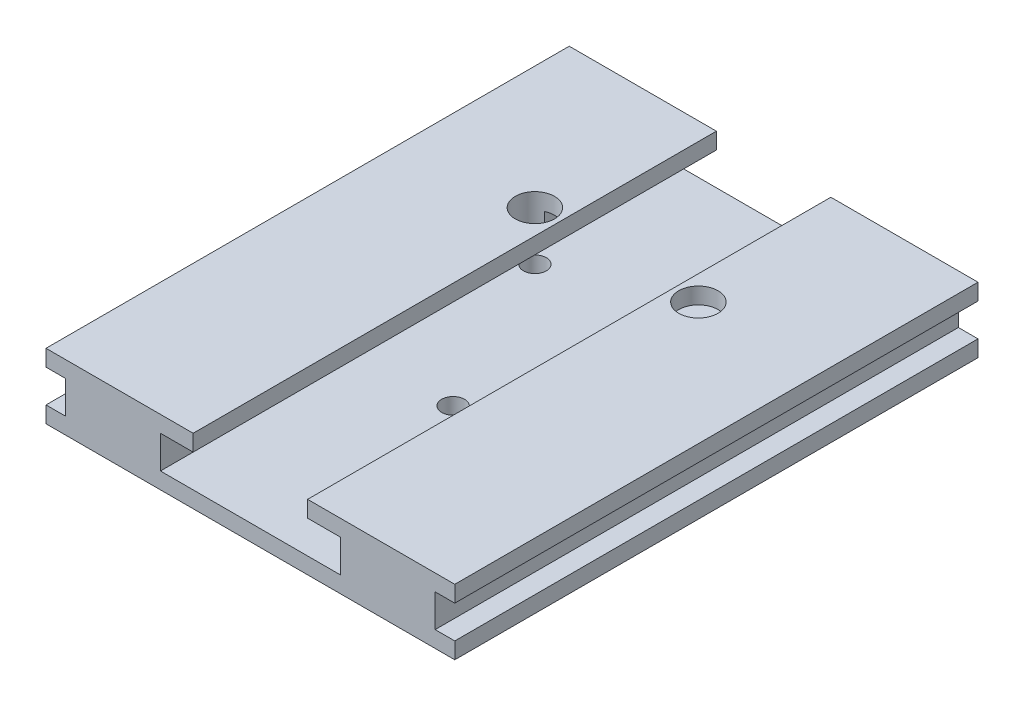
ISO-10303-21;
HEADER;
FILE_DESCRIPTION(('STEP AP214'),'2;1');
FILE_NAME('part.step','',(''),(''),'','','');
FILE_SCHEMA(('AUTOMOTIVE_DESIGN { 1 0 10303 214 1 1 1 1 }'));
ENDSEC;
DATA;
#1=APPLICATION_CONTEXT('core data for automotive mechanical design processes');
#2=APPLICATION_PROTOCOL_DEFINITION('international standard','automotive_design',2000,#1);
#3=PRODUCT_CONTEXT('',#1,'mechanical');
#4=PRODUCT('Part','Part','',(#3));
#5=PRODUCT_RELATED_PRODUCT_CATEGORY('part','',(#4));
#6=PRODUCT_DEFINITION_FORMATION('','',#4);
#7=PRODUCT_DEFINITION_CONTEXT('part definition',#1,'design');
#8=PRODUCT_DEFINITION('design','',#6,#7);
#9=PRODUCT_DEFINITION_SHAPE('','',#8);
#10=(LENGTH_UNIT() NAMED_UNIT(*) SI_UNIT(.MILLI.,.METRE.));
#11=(NAMED_UNIT(*) PLANE_ANGLE_UNIT() SI_UNIT($,.RADIAN.));
#12=(NAMED_UNIT(*) SI_UNIT($,.STERADIAN.) SOLID_ANGLE_UNIT());
#13=UNCERTAINTY_MEASURE_WITH_UNIT(LENGTH_MEASURE(1.E-05),#10,'distance_accuracy_value','');
#14=(GEOMETRIC_REPRESENTATION_CONTEXT(3) GLOBAL_UNCERTAINTY_ASSIGNED_CONTEXT((#13)) GLOBAL_UNIT_ASSIGNED_CONTEXT((#10,
#11,#12)) REPRESENTATION_CONTEXT('',''));
#15=CARTESIAN_POINT('',(0.,0.,0.));
#16=DIRECTION('',(0.,0.,1.));
#17=DIRECTION('',(1.,0.,0.));
#18=AXIS2_PLACEMENT_3D('',#15,#16,#17);
#19=CARTESIAN_POINT('',(41.2911870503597,-47.1775179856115,248.));
#20=DIRECTION('',(0.,-1.,0.));
#21=DIRECTION('',(0.,0.,-1.));
#22=AXIS2_PLACEMENT_3D('',#19,#20,#21);
#23=CYLINDRICAL_SURFACE('',#22,3.5);
#24=CARTESIAN_POINT('',(41.2911870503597,-67.1775179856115,248.));
#25=DIRECTION('',(0.,-1.,0.));
#26=DIRECTION('',(0.,0.,-1.));
#27=AXIS2_PLACEMENT_3D('',#24,#25,#26);
#28=CIRCLE('',#27,3.5);
#29=CARTESIAN_POINT('',(41.2911870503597,-67.1775179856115,244.5));
#30=VERTEX_POINT('',#29);
#31=EDGE_CURVE('E312',#30,#30,#28,.T.);
#32=ORIENTED_EDGE('',*,*,#31,.T.);
#33=EDGE_LOOP('',(#32));
#34=FACE_BOUND('',#33,.T.);
#35=CARTESIAN_POINT('',(41.2911870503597,-62.1775179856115,248.));
#36=DIRECTION('',(0.,-1.,0.));
#37=DIRECTION('',(1.,0.,0.));
#38=AXIS2_PLACEMENT_3D('',#35,#36,#37);
#39=CIRCLE('',#38,3.5);
#40=CARTESIAN_POINT('',(44.7911870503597,-62.1775179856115,248.));
#41=VERTEX_POINT('',#40);
#42=EDGE_CURVE('E293',#41,#41,#39,.T.);
#43=ORIENTED_EDGE('',*,*,#42,.F.);
#44=EDGE_LOOP('',(#43));
#45=FACE_BOUND('',#44,.T.);
#46=ADVANCED_FACE('F33',(#34,#45),#23,.F.);
#47=CARTESIAN_POINT('',(-8.70881294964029,-47.1775179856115,248.));
#48=DIRECTION('',(0.,-1.,0.));
#49=DIRECTION('',(0.,0.,-1.));
#50=AXIS2_PLACEMENT_3D('',#47,#48,#49);
#51=CYLINDRICAL_SURFACE('',#50,3.5);
#52=CARTESIAN_POINT('',(-8.70881294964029,-67.1775179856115,248.));
#53=DIRECTION('',(0.,-1.,0.));
#54=DIRECTION('',(0.,0.,-1.));
#55=AXIS2_PLACEMENT_3D('',#52,#53,#54);
#56=CIRCLE('',#55,3.5);
#57=CARTESIAN_POINT('',(-8.70881294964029,-67.1775179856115,244.5));
#58=VERTEX_POINT('',#57);
#59=EDGE_CURVE('E298',#58,#58,#56,.T.);
#60=ORIENTED_EDGE('',*,*,#59,.T.);
#61=EDGE_LOOP('',(#60));
#62=FACE_BOUND('',#61,.T.);
#63=CARTESIAN_POINT('',(-8.70881294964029,-62.1775179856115,248.));
#64=DIRECTION('',(0.,-1.,0.));
#65=DIRECTION('',(1.,0.,0.));
#66=AXIS2_PLACEMENT_3D('',#63,#64,#65);
#67=CIRCLE('',#66,3.5);
#68=CARTESIAN_POINT('',(-5.20881294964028,-62.1775179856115,248.));
#69=VERTEX_POINT('',#68);
#70=EDGE_CURVE('E416',#69,#69,#67,.T.);
#71=ORIENTED_EDGE('',*,*,#70,.F.);
#72=EDGE_LOOP('',(#71));
#73=FACE_BOUND('',#72,.T.);
#74=ADVANCED_FACE('F473',(#62,#73),#51,.F.);
#75=CARTESIAN_POINT('',(-11.2088129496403,-62.1775179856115,0.));
#76=DIRECTION('',(-1.,0.,0.));
#77=DIRECTION('',(0.,0.,1.));
#78=AXIS2_PLACEMENT_3D('',#75,#76,#77);
#79=PLANE('',#78);
#80=DIRECTION('',(0.,0.,1.));
#81=VECTOR('',#80,1.);
#82=CARTESIAN_POINT('',(-11.2088129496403,-52.1775179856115,0.));
#83=LINE('',#82,#81);
#84=CARTESIAN_POINT('',(-11.2088129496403,-52.1775179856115,200.));
#85=VERTEX_POINT('',#84);
#86=CARTESIAN_POINT('',(-11.2088129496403,-52.1775179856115,242.545643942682));
#87=VERTEX_POINT('',#86);
#88=EDGE_CURVE('E214',#85,#87,#83,.T.);
#89=ORIENTED_EDGE('',*,*,#88,.T.);
#90=DIRECTION('',(0.,1.,0.));
#91=VECTOR('',#90,1.);
#92=CARTESIAN_POINT('',(-11.2088129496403,-62.1775179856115,242.545643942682));
#93=LINE('',#92,#91);
#94=CARTESIAN_POINT('',(-11.2088129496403,-62.1775179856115,242.545643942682));
#95=VERTEX_POINT('',#94);
#96=EDGE_CURVE('E198',#87,#95,#93,.F.);
#97=ORIENTED_EDGE('',*,*,#96,.T.);
#98=DIRECTION('',(0.,0.,1.));
#99=VECTOR('',#98,1.);
#100=CARTESIAN_POINT('',(-11.2088129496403,-62.1775179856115,0.));
#101=LINE('',#100,#99);
#102=CARTESIAN_POINT('',(-11.2088129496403,-62.1775179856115,200.));
#103=VERTEX_POINT('',#102);
#104=EDGE_CURVE('E212',#103,#95,#101,.T.);
#105=ORIENTED_EDGE('',*,*,#104,.F.);
#106=DIRECTION('',(0.,1.,0.));
#107=VECTOR('',#106,1.);
#108=CARTESIAN_POINT('',(-11.2088129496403,-62.1775179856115,200.));
#109=LINE('',#108,#107);
#110=EDGE_CURVE('E379',#103,#85,#109,.T.);
#111=ORIENTED_EDGE('',*,*,#110,.T.);
#112=EDGE_LOOP('',(#89,#97,#105,#111));
#113=FACE_BOUND('',#112,.T.);
#114=ADVANCED_FACE('F210',(#113),#79,.F.);
#115=CARTESIAN_POINT('',(43.7911870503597,-52.1775179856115,0.));
#116=DIRECTION('',(1.,0.,0.));
#117=DIRECTION('',(0.,0.,-1.));
#118=AXIS2_PLACEMENT_3D('',#115,#116,#117);
#119=PLANE('',#118);
#120=DIRECTION('',(0.,0.,1.));
#121=VECTOR('',#120,1.);
#122=CARTESIAN_POINT('',(43.7911870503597,-52.1775179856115,0.));
#123=LINE('',#122,#121);
#124=CARTESIAN_POINT('',(43.7911870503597,-52.1775179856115,253.454356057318));
#125=VERTEX_POINT('',#124);
#126=CARTESIAN_POINT('',(43.7911870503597,-52.1775179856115,360.));
#127=VERTEX_POINT('',#126);
#128=EDGE_CURVE('E340',#125,#127,#123,.T.);
#129=ORIENTED_EDGE('',*,*,#128,.F.);
#130=DIRECTION('',(0.,1.,0.));
#131=VECTOR('',#130,1.);
#132=CARTESIAN_POINT('',(43.7911870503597,-62.1775179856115,253.454356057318));
#133=LINE('',#132,#131);
#134=CARTESIAN_POINT('',(43.7911870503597,-62.1775179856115,253.454356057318));
#135=VERTEX_POINT('',#134);
#136=EDGE_CURVE('E367',#125,#135,#133,.F.);
#137=ORIENTED_EDGE('',*,*,#136,.T.);
#138=DIRECTION('',(0.,0.,1.));
#139=VECTOR('',#138,1.);
#140=CARTESIAN_POINT('',(43.7911870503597,-62.1775179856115,0.));
#141=LINE('',#140,#139);
#142=CARTESIAN_POINT('',(43.7911870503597,-62.1775179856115,360.));
#143=VERTEX_POINT('',#142);
#144=EDGE_CURVE('E222',#135,#143,#141,.T.);
#145=ORIENTED_EDGE('',*,*,#144,.T.);
#146=DIRECTION('',(0.,1.,0.));
#147=VECTOR('',#146,1.);
#148=CARTESIAN_POINT('',(43.7911870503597,-52.1775179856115,360.));
#149=LINE('',#148,#147);
#150=EDGE_CURVE('E326',#143,#127,#149,.T.);
#151=ORIENTED_EDGE('',*,*,#150,.T.);
#152=EDGE_LOOP('',(#129,#137,#145,#151));
#153=FACE_BOUND('',#152,.T.);
#154=ADVANCED_FACE('F456',(#153),#119,.F.);
#155=CARTESIAN_POINT('',(-46.2088129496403,-47.1775179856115,360.));
#156=DIRECTION('',(0.,-1.,0.));
#157=DIRECTION('',(0.,0.,-1.));
#158=AXIS2_PLACEMENT_3D('',#155,#156,#157);
#159=PLANE('',#158);
#160=CARTESIAN_POINT('',(-8.70881294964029,-47.1775179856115,248.));
#161=DIRECTION('',(0.,1.,0.));
#162=DIRECTION('',(0.,0.,1.));
#163=AXIS2_PLACEMENT_3D('',#160,#161,#162);
#164=CIRCLE('',#163,6.);
#165=CARTESIAN_POINT('',(-8.70881294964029,-47.1775179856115,254.));
#166=VERTEX_POINT('',#165);
#167=EDGE_CURVE('E205',#166,#166,#164,.T.);
#168=ORIENTED_EDGE('',*,*,#167,.F.);
#169=EDGE_LOOP('',(#168));
#170=FACE_BOUND('',#169,.T.);
#171=DIRECTION('',(0.,0.,1.));
#172=VECTOR('',#171,1.);
#173=CARTESIAN_POINT('',(-1.20881294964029,-47.1775179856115,0.));
#174=LINE('',#173,#172);
#175=CARTESIAN_POINT('',(-1.20881294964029,-47.1775179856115,200.));
#176=VERTEX_POINT('',#175);
#177=CARTESIAN_POINT('',(-1.20881294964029,-47.1775179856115,360.));
#178=VERTEX_POINT('',#177);
#179=EDGE_CURVE('E238',#176,#178,#174,.T.);
#180=ORIENTED_EDGE('',*,*,#179,.F.);
#181=DIRECTION('',(1.,0.,0.));
#182=VECTOR('',#181,1.);
#183=CARTESIAN_POINT('',(-46.2088129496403,-47.1775179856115,200.));
#184=LINE('',#183,#182);
#185=CARTESIAN_POINT('',(-46.2088129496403,-47.1775179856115,200.));
#186=VERTEX_POINT('',#185);
#187=EDGE_CURVE('E374',#186,#176,#184,.T.);
#188=ORIENTED_EDGE('',*,*,#187,.F.);
#189=DIRECTION('',(0.,0.,-1.));
#190=VECTOR('',#189,1.);
#191=CARTESIAN_POINT('',(-46.2088129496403,-47.1775179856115,360.));
#192=LINE('',#191,#190);
#193=CARTESIAN_POINT('',(-46.2088129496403,-47.1775179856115,360.));
#194=VERTEX_POINT('',#193);
#195=EDGE_CURVE('E281',#194,#186,#192,.T.);
#196=ORIENTED_EDGE('',*,*,#195,.F.);
#197=DIRECTION('',(-1.,0.,0.));
#198=VECTOR('',#197,1.);
#199=CARTESIAN_POINT('',(-46.2088129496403,-47.1775179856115,360.));
#200=LINE('',#199,#198);
#201=EDGE_CURVE('E56',#178,#194,#200,.T.);
#202=ORIENTED_EDGE('',*,*,#201,.F.);
#203=EDGE_LOOP('',(#180,#188,#196,#202));
#204=FACE_BOUND('',#203,.T.);
#205=ADVANCED_FACE('F454',(#170,#204),#159,.F.);
#206=CARTESIAN_POINT('',(-46.2088129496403,-47.1775179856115,360.));
#207=DIRECTION('',(1.,0.,0.));
#208=DIRECTION('',(0.,0.,-1.));
#209=AXIS2_PLACEMENT_3D('',#206,#207,#208);
#210=PLANE('',#209);
#211=ORIENTED_EDGE('',*,*,#195,.T.);
#212=DIRECTION('',(0.,1.,0.));
#213=VECTOR('',#212,1.);
#214=CARTESIAN_POINT('',(-46.2088129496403,-67.1775179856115,200.));
#215=LINE('',#214,#213);
#216=CARTESIAN_POINT('',(-46.2088129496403,-52.1775179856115,200.));
#217=VERTEX_POINT('',#216);
#218=EDGE_CURVE('E373',#217,#186,#215,.T.);
#219=ORIENTED_EDGE('',*,*,#218,.F.);
#220=DIRECTION('',(0.,0.,1.));
#221=VECTOR('',#220,1.);
#222=CARTESIAN_POINT('',(-46.2088129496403,-52.1775179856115,0.));
#223=LINE('',#222,#221);
#224=CARTESIAN_POINT('',(-46.2088129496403,-52.1775179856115,360.));
#225=VERTEX_POINT('',#224);
#226=EDGE_CURVE('E245',#217,#225,#223,.T.);
#227=ORIENTED_EDGE('',*,*,#226,.T.);
#228=DIRECTION('',(0.,-1.,0.));
#229=VECTOR('',#228,1.);
#230=CARTESIAN_POINT('',(-46.2088129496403,-47.1775179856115,360.));
#231=LINE('',#230,#229);
#232=EDGE_CURVE('E270',#194,#225,#231,.T.);
#233=ORIENTED_EDGE('',*,*,#232,.F.);
#234=EDGE_LOOP('',(#211,#219,#227,#233));
#235=FACE_BOUND('',#234,.T.);
#236=ADVANCED_FACE('F451',(#235),#210,.F.);
#237=CARTESIAN_POINT('',(78.7911870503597,-47.1775179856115,360.));
#238=DIRECTION('',(-1.,0.,0.));
#239=DIRECTION('',(0.,-1.,0.));
#240=AXIS2_PLACEMENT_3D('',#237,#238,#239);
#241=PLANE('',#240);
#242=DIRECTION('',(0.,0.,-1.));
#243=VECTOR('',#242,1.);
#244=CARTESIAN_POINT('',(78.7911870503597,-67.1775179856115,360.));
#245=LINE('',#244,#243);
#246=CARTESIAN_POINT('',(78.7911870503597,-67.1775179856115,360.));
#247=VERTEX_POINT('',#246);
#248=CARTESIAN_POINT('',(78.7911870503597,-67.1775179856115,200.));
#249=VERTEX_POINT('',#248);
#250=EDGE_CURVE('E287',#247,#249,#245,.T.);
#251=ORIENTED_EDGE('',*,*,#250,.T.);
#252=DIRECTION('',(0.,1.,0.));
#253=VECTOR('',#252,1.);
#254=CARTESIAN_POINT('',(78.7911870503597,-47.1775179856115,200.));
#255=LINE('',#254,#253);
#256=CARTESIAN_POINT('',(78.7911870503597,-62.1775179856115,200.));
#257=VERTEX_POINT('',#256);
#258=EDGE_CURVE('E409',#249,#257,#255,.T.);
#259=ORIENTED_EDGE('',*,*,#258,.T.);
#260=DIRECTION('',(0.,0.,1.));
#261=VECTOR('',#260,1.);
#262=CARTESIAN_POINT('',(78.7911870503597,-62.1775179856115,0.));
#263=LINE('',#262,#261);
#264=CARTESIAN_POINT('',(78.7911870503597,-62.1775179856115,360.));
#265=VERTEX_POINT('',#264);
#266=EDGE_CURVE('E262',#257,#265,#263,.T.);
#267=ORIENTED_EDGE('',*,*,#266,.T.);
#268=DIRECTION('',(0.,1.,0.));
#269=VECTOR('',#268,1.);
#270=CARTESIAN_POINT('',(78.7911870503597,-47.1775179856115,360.));
#271=LINE('',#270,#269);
#272=EDGE_CURVE('E275',#247,#265,#271,.T.);
#273=ORIENTED_EDGE('',*,*,#272,.F.);
#274=EDGE_LOOP('',(#251,#259,#267,#273));
#275=FACE_BOUND('',#274,.T.);
#276=ADVANCED_FACE('F464',(#275),#241,.F.);
#277=DIRECTION('',(0.,0.,1.));
#278=VECTOR('',#277,1.);
#279=CARTESIAN_POINT('',(-46.2088129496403,-62.1775179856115,0.));
#280=LINE('',#279,#278);
#281=CARTESIAN_POINT('',(-46.2088129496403,-62.1775179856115,200.));
#282=VERTEX_POINT('',#281);
#283=CARTESIAN_POINT('',(-46.2088129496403,-62.1775179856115,360.));
#284=VERTEX_POINT('',#283);
#285=EDGE_CURVE('E244',#282,#284,#280,.T.);
#286=ORIENTED_EDGE('',*,*,#285,.F.);
#287=CARTESIAN_POINT('',(-46.2088129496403,-67.1775179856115,200.));
#288=VERTEX_POINT('',#287);
#289=EDGE_CURVE('E376',#288,#282,#215,.T.);
#290=ORIENTED_EDGE('',*,*,#289,.F.);
#291=DIRECTION('',(0.,0.,-1.));
#292=VECTOR('',#291,1.);
#293=CARTESIAN_POINT('',(-46.2088129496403,-67.1775179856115,360.));
#294=LINE('',#293,#292);
#295=CARTESIAN_POINT('',(-46.2088129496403,-67.1775179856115,360.));
#296=VERTEX_POINT('',#295);
#297=EDGE_CURVE('E290',#296,#288,#294,.T.);
#298=ORIENTED_EDGE('',*,*,#297,.F.);
#299=EDGE_CURVE('E264',#284,#296,#231,.T.);
#300=ORIENTED_EDGE('',*,*,#299,.F.);
#301=EDGE_LOOP('',(#286,#290,#298,#300));
#302=FACE_BOUND('',#301,.T.);
#303=ADVANCED_FACE('F35',(#302),#210,.F.);
#304=CARTESIAN_POINT('',(-46.2088129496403,-67.1775179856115,360.));
#305=DIRECTION('',(0.,1.,0.));
#306=DIRECTION('',(0.,0.,1.));
#307=AXIS2_PLACEMENT_3D('',#304,#305,#306);
#308=PLANE('',#307);
#309=CARTESIAN_POINT('',(16.2911870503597,-67.1775179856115,298.));
#310=DIRECTION('',(0.,-1.,0.));
#311=DIRECTION('',(0.,0.,-1.));
#312=AXIS2_PLACEMENT_3D('',#309,#310,#311);
#313=CIRCLE('',#312,3.5);
#314=CARTESIAN_POINT('',(16.2911870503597,-67.1775179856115,294.5));
#315=VERTEX_POINT('',#314);
#316=EDGE_CURVE('E299',#315,#315,#313,.T.);
#317=ORIENTED_EDGE('',*,*,#316,.F.);
#318=EDGE_LOOP('',(#317));
#319=FACE_BOUND('',#318,.T.);
#320=ORIENTED_EDGE('',*,*,#59,.F.);
#321=EDGE_LOOP('',(#320));
#322=FACE_BOUND('',#321,.T.);
#323=ORIENTED_EDGE('',*,*,#31,.F.);
#324=EDGE_LOOP('',(#323));
#325=FACE_BOUND('',#324,.T.);
#326=ORIENTED_EDGE('',*,*,#297,.T.);
#327=DIRECTION('',(1.,0.,0.));
#328=VECTOR('',#327,1.);
#329=CARTESIAN_POINT('',(-46.2088129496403,-67.1775179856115,200.));
#330=LINE('',#329,#328);
#331=EDGE_CURVE('E370',#288,#249,#330,.T.);
#332=ORIENTED_EDGE('',*,*,#331,.T.);
#333=ORIENTED_EDGE('',*,*,#250,.F.);
#334=DIRECTION('',(1.,0.,0.));
#335=VECTOR('',#334,1.);
#336=CARTESIAN_POINT('',(-46.2088129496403,-67.1775179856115,360.));
#337=LINE('',#336,#335);
#338=EDGE_CURVE('E272',#296,#247,#337,.T.);
#339=ORIENTED_EDGE('',*,*,#338,.F.);
#340=EDGE_LOOP('',(#326,#332,#333,#339));
#341=FACE_BOUND('',#340,.T.);
#342=ADVANCED_FACE('F423',(#319,#322,#325,#341),#308,.F.);
#343=DIRECTION('',(0.,0.,1.));
#344=VECTOR('',#343,1.);
#345=CARTESIAN_POINT('',(78.7911870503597,-52.1775179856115,0.));
#346=LINE('',#345,#344);
#347=CARTESIAN_POINT('',(78.7911870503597,-52.1775179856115,200.));
#348=VERTEX_POINT('',#347);
#349=CARTESIAN_POINT('',(78.7911870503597,-52.1775179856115,360.));
#350=VERTEX_POINT('',#349);
#351=EDGE_CURVE('E261',#348,#350,#346,.T.);
#352=ORIENTED_EDGE('',*,*,#351,.F.);
#353=DIRECTION('',(0.,1.,0.));
#354=VECTOR('',#353,1.);
#355=CARTESIAN_POINT('',(78.7911870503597,-47.1775179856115,200.));
#356=LINE('',#355,#354);
#357=CARTESIAN_POINT('',(78.7911870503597,-47.1775179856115,200.));
#358=VERTEX_POINT('',#357);
#359=EDGE_CURVE('E406',#348,#358,#356,.T.);
#360=ORIENTED_EDGE('',*,*,#359,.T.);
#361=DIRECTION('',(0.,0.,-1.));
#362=VECTOR('',#361,1.);
#363=CARTESIAN_POINT('',(78.7911870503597,-47.1775179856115,360.));
#364=LINE('',#363,#362);
#365=CARTESIAN_POINT('',(78.7911870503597,-47.1775179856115,360.));
#366=VERTEX_POINT('',#365);
#367=EDGE_CURVE('E284',#366,#358,#364,.T.);
#368=ORIENTED_EDGE('',*,*,#367,.F.);
#369=EDGE_CURVE('E274',#350,#366,#271,.T.);
#370=ORIENTED_EDGE('',*,*,#369,.F.);
#371=EDGE_LOOP('',(#352,#360,#368,#370));
#372=FACE_BOUND('',#371,.T.);
#373=ADVANCED_FACE('F426',(#372),#241,.F.);
#374=CARTESIAN_POINT('',(41.2911870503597,-47.1775179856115,248.));
#375=DIRECTION('',(0.,1.,0.));
#376=DIRECTION('',(0.,0.,1.));
#377=AXIS2_PLACEMENT_3D('',#374,#375,#376);
#378=CIRCLE('',#377,6.);
#379=CARTESIAN_POINT('',(41.2911870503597,-47.1775179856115,254.));
#380=VERTEX_POINT('',#379);
#381=EDGE_CURVE('E204',#380,#380,#378,.T.);
#382=ORIENTED_EDGE('',*,*,#381,.F.);
#383=EDGE_LOOP('',(#382));
#384=FACE_BOUND('',#383,.T.);
#385=ORIENTED_EDGE('',*,*,#367,.T.);
#386=CARTESIAN_POINT('',(33.7911870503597,-47.1775179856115,200.));
#387=VERTEX_POINT('',#386);
#388=EDGE_CURVE('E369',#387,#358,#184,.T.);
#389=ORIENTED_EDGE('',*,*,#388,.F.);
#390=DIRECTION('',(0.,0.,1.));
#391=VECTOR('',#390,1.);
#392=CARTESIAN_POINT('',(33.7911870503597,-47.1775179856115,0.));
#393=LINE('',#392,#391);
#394=CARTESIAN_POINT('',(33.7911870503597,-47.1775179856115,360.));
#395=VERTEX_POINT('',#394);
#396=EDGE_CURVE('E335',#387,#395,#393,.T.);
#397=ORIENTED_EDGE('',*,*,#396,.T.);
#398=EDGE_CURVE('E278',#366,#395,#200,.T.);
#399=ORIENTED_EDGE('',*,*,#398,.F.);
#400=EDGE_LOOP('',(#385,#389,#397,#399));
#401=FACE_BOUND('',#400,.T.);
#402=ADVANCED_FACE('F459',(#384,#401),#159,.F.);
#403=CARTESIAN_POINT('',(-46.2088129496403,-67.1775179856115,360.));
#404=DIRECTION('',(0.,0.,1.));
#405=DIRECTION('',(1.,0.,0.));
#406=AXIS2_PLACEMENT_3D('',#403,#404,#405);
#407=PLANE('',#406);
#408=DIRECTION('',(0.,-1.,0.));
#409=VECTOR('',#408,1.);
#410=CARTESIAN_POINT('',(-1.20881294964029,-47.1775179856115,360.));
#411=LINE('',#410,#409);
#412=CARTESIAN_POINT('',(-1.20881294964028,-52.1775179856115,360.));
#413=VERTEX_POINT('',#412);
#414=EDGE_CURVE('E309',#178,#413,#411,.T.);
#415=ORIENTED_EDGE('',*,*,#414,.F.);
#416=ORIENTED_EDGE('',*,*,#201,.T.);
#417=ORIENTED_EDGE('',*,*,#232,.T.);
#418=DIRECTION('',(-1.,0.,0.));
#419=VECTOR('',#418,1.);
#420=CARTESIAN_POINT('',(-46.2088129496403,-52.1775179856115,360.));
#421=LINE('',#420,#419);
#422=CARTESIAN_POINT('',(-40.2088129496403,-52.1775179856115,360.));
#423=VERTEX_POINT('',#422);
#424=EDGE_CURVE('E241',#423,#225,#421,.T.);
#425=ORIENTED_EDGE('',*,*,#424,.F.);
#426=DIRECTION('',(0.,1.,0.));
#427=VECTOR('',#426,1.);
#428=CARTESIAN_POINT('',(-40.2088129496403,-52.1775179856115,360.));
#429=LINE('',#428,#427);
#430=CARTESIAN_POINT('',(-40.2088129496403,-62.1775179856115,360.));
#431=VERTEX_POINT('',#430);
#432=EDGE_CURVE('E237',#431,#423,#429,.T.);
#433=ORIENTED_EDGE('',*,*,#432,.F.);
#434=DIRECTION('',(1.,0.,0.));
#435=VECTOR('',#434,1.);
#436=CARTESIAN_POINT('',(-46.2088129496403,-62.1775179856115,360.));
#437=LINE('',#436,#435);
#438=EDGE_CURVE('E234',#284,#431,#437,.T.);
#439=ORIENTED_EDGE('',*,*,#438,.F.);
#440=ORIENTED_EDGE('',*,*,#299,.T.);
#441=ORIENTED_EDGE('',*,*,#338,.T.);
#442=ORIENTED_EDGE('',*,*,#272,.T.);
#443=DIRECTION('',(1.,0.,0.));
#444=VECTOR('',#443,1.);
#445=CARTESIAN_POINT('',(78.7911870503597,-62.1775179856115,360.));
#446=LINE('',#445,#444);
#447=CARTESIAN_POINT('',(72.7911870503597,-62.1775179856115,360.));
#448=VERTEX_POINT('',#447);
#449=EDGE_CURVE('E258',#448,#265,#446,.T.);
#450=ORIENTED_EDGE('',*,*,#449,.F.);
#451=DIRECTION('',(0.,-1.,0.));
#452=VECTOR('',#451,1.);
#453=CARTESIAN_POINT('',(72.7911870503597,-52.1775179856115,360.));
#454=LINE('',#453,#452);
#455=CARTESIAN_POINT('',(72.7911870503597,-52.1775179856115,360.));
#456=VERTEX_POINT('',#455);
#457=EDGE_CURVE('E255',#456,#448,#454,.T.);
#458=ORIENTED_EDGE('',*,*,#457,.F.);
#459=DIRECTION('',(-1.,0.,0.));
#460=VECTOR('',#459,1.);
#461=CARTESIAN_POINT('',(78.7911870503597,-52.1775179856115,360.));
#462=LINE('',#461,#460);
#463=EDGE_CURVE('E247',#350,#456,#462,.T.);
#464=ORIENTED_EDGE('',*,*,#463,.F.);
#465=ORIENTED_EDGE('',*,*,#369,.T.);
#466=ORIENTED_EDGE('',*,*,#398,.T.);
#467=DIRECTION('',(0.,1.,0.));
#468=VECTOR('',#467,1.);
#469=CARTESIAN_POINT('',(33.7911870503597,-47.1775179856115,360.));
#470=LINE('',#469,#468);
#471=CARTESIAN_POINT('',(33.7911870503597,-52.1775179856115,360.));
#472=VERTEX_POINT('',#471);
#473=EDGE_CURVE('E233',#472,#395,#470,.T.);
#474=ORIENTED_EDGE('',*,*,#473,.F.);
#475=DIRECTION('',(-1.,0.,0.));
#476=VECTOR('',#475,1.);
#477=CARTESIAN_POINT('',(33.7911870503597,-52.1775179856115,360.));
#478=LINE('',#477,#476);
#479=EDGE_CURVE('E329',#127,#472,#478,.T.);
#480=ORIENTED_EDGE('',*,*,#479,.F.);
#481=ORIENTED_EDGE('',*,*,#150,.F.);
#482=DIRECTION('',(1.,0.,0.));
#483=VECTOR('',#482,1.);
#484=CARTESIAN_POINT('',(43.7911870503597,-62.1775179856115,360.));
#485=LINE('',#484,#483);
#486=CARTESIAN_POINT('',(-11.2088129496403,-62.1775179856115,360.));
#487=VERTEX_POINT('',#486);
#488=EDGE_CURVE('E320',#487,#143,#485,.T.);
#489=ORIENTED_EDGE('',*,*,#488,.F.);
#490=DIRECTION('',(0.,-1.,0.));
#491=VECTOR('',#490,1.);
#492=CARTESIAN_POINT('',(-11.2088129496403,-62.1775179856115,360.));
#493=LINE('',#492,#491);
#494=CARTESIAN_POINT('',(-11.2088129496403,-52.1775179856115,360.));
#495=VERTEX_POINT('',#494);
#496=EDGE_CURVE('E318',#495,#487,#493,.T.);
#497=ORIENTED_EDGE('',*,*,#496,.F.);
#498=DIRECTION('',(-1.,0.,0.));
#499=VECTOR('',#498,1.);
#500=CARTESIAN_POINT('',(-11.2088129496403,-52.1775179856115,360.));
#501=LINE('',#500,#499);
#502=EDGE_CURVE('E311',#413,#495,#501,.T.);
#503=ORIENTED_EDGE('',*,*,#502,.F.);
#504=EDGE_LOOP('',(#415,#416,#417,#425,#433,#439,#440,#441,#442,#450,#458,#464,#465,#466,#474,
#480,#481,#489,#497,#503));
#505=FACE_BOUND('',#504,.T.);
#506=ADVANCED_FACE('F315',(#505),#407,.T.);
#507=CARTESIAN_POINT('',(78.7911870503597,-62.1775179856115,0.));
#508=DIRECTION('',(0.,-1.,0.));
#509=DIRECTION('',(0.,0.,-1.));
#510=AXIS2_PLACEMENT_3D('',#507,#508,#509);
#511=PLANE('',#510);
#512=ORIENTED_EDGE('',*,*,#266,.F.);
#513=DIRECTION('',(-1.,0.,0.));
#514=VECTOR('',#513,1.);
#515=CARTESIAN_POINT('',(78.7911870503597,-62.1775179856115,200.));
#516=LINE('',#515,#514);
#517=CARTESIAN_POINT('',(72.7911870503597,-62.1775179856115,200.));
#518=VERTEX_POINT('',#517);
#519=EDGE_CURVE('E403',#257,#518,#516,.T.);
#520=ORIENTED_EDGE('',*,*,#519,.T.);
#521=DIRECTION('',(0.,0.,1.));
#522=VECTOR('',#521,1.);
#523=CARTESIAN_POINT('',(72.7911870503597,-62.1775179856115,0.));
#524=LINE('',#523,#522);
#525=EDGE_CURVE('E265',#518,#448,#524,.T.);
#526=ORIENTED_EDGE('',*,*,#525,.T.);
#527=ORIENTED_EDGE('',*,*,#449,.T.);
#528=EDGE_LOOP('',(#512,#520,#526,#527));
#529=FACE_BOUND('',#528,.T.);
#530=ADVANCED_FACE('F508',(#529),#511,.F.);
#531=CARTESIAN_POINT('',(72.7911870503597,-52.1775179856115,0.));
#532=DIRECTION('',(-1.,0.,0.));
#533=DIRECTION('',(0.,-1.,0.));
#534=AXIS2_PLACEMENT_3D('',#531,#532,#533);
#535=PLANE('',#534);
#536=ORIENTED_EDGE('',*,*,#525,.F.);
#537=DIRECTION('',(0.,1.,0.));
#538=VECTOR('',#537,1.);
#539=CARTESIAN_POINT('',(72.7911870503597,-52.1775179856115,200.));
#540=LINE('',#539,#538);
#541=CARTESIAN_POINT('',(72.7911870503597,-52.1775179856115,200.));
#542=VERTEX_POINT('',#541);
#543=EDGE_CURVE('E400',#518,#542,#540,.T.);
#544=ORIENTED_EDGE('',*,*,#543,.T.);
#545=DIRECTION('',(0.,0.,1.));
#546=VECTOR('',#545,1.);
#547=CARTESIAN_POINT('',(72.7911870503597,-52.1775179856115,0.));
#548=LINE('',#547,#546);
#549=EDGE_CURVE('E267',#542,#456,#548,.T.);
#550=ORIENTED_EDGE('',*,*,#549,.T.);
#551=ORIENTED_EDGE('',*,*,#457,.T.);
#552=EDGE_LOOP('',(#536,#544,#550,#551));
#553=FACE_BOUND('',#552,.T.);
#554=ADVANCED_FACE('F511',(#553),#535,.F.);
#555=CARTESIAN_POINT('',(78.7911870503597,-52.1775179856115,0.));
#556=DIRECTION('',(0.,1.,0.));
#557=DIRECTION('',(0.,0.,1.));
#558=AXIS2_PLACEMENT_3D('',#555,#556,#557);
#559=PLANE('',#558);
#560=ORIENTED_EDGE('',*,*,#549,.F.);
#561=DIRECTION('',(1.,0.,0.));
#562=VECTOR('',#561,1.);
#563=CARTESIAN_POINT('',(78.7911870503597,-52.1775179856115,200.));
#564=LINE('',#563,#562);
#565=EDGE_CURVE('E397',#542,#348,#564,.T.);
#566=ORIENTED_EDGE('',*,*,#565,.T.);
#567=ORIENTED_EDGE('',*,*,#351,.T.);
#568=ORIENTED_EDGE('',*,*,#463,.T.);
#569=EDGE_LOOP('',(#560,#566,#567,#568));
#570=FACE_BOUND('',#569,.T.);
#571=ADVANCED_FACE('F503',(#570),#559,.F.);
#572=CARTESIAN_POINT('',(-46.2088129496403,-52.1775179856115,0.));
#573=DIRECTION('',(0.,1.,0.));
#574=DIRECTION('',(0.,0.,1.));
#575=AXIS2_PLACEMENT_3D('',#572,#573,#574);
#576=PLANE('',#575);
#577=ORIENTED_EDGE('',*,*,#226,.F.);
#578=DIRECTION('',(1.,0.,0.));
#579=VECTOR('',#578,1.);
#580=CARTESIAN_POINT('',(-46.2088129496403,-52.1775179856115,200.));
#581=LINE('',#580,#579);
#582=CARTESIAN_POINT('',(-40.2088129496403,-52.1775179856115,200.));
#583=VERTEX_POINT('',#582);
#584=EDGE_CURVE('E394',#217,#583,#581,.T.);
#585=ORIENTED_EDGE('',*,*,#584,.T.);
#586=DIRECTION('',(0.,0.,1.));
#587=VECTOR('',#586,1.);
#588=CARTESIAN_POINT('',(-40.2088129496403,-52.1775179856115,0.));
#589=LINE('',#588,#587);
#590=EDGE_CURVE('E248',#583,#423,#589,.T.);
#591=ORIENTED_EDGE('',*,*,#590,.T.);
#592=ORIENTED_EDGE('',*,*,#424,.T.);
#593=EDGE_LOOP('',(#577,#585,#591,#592));
#594=FACE_BOUND('',#593,.T.);
#595=ADVANCED_FACE('F448',(#594),#576,.F.);
#596=CARTESIAN_POINT('',(-40.2088129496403,-52.1775179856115,0.));
#597=DIRECTION('',(1.,0.,0.));
#598=DIRECTION('',(0.,1.,0.));
#599=AXIS2_PLACEMENT_3D('',#596,#597,#598);
#600=PLANE('',#599);
#601=ORIENTED_EDGE('',*,*,#590,.F.);
#602=DIRECTION('',(0.,-1.,0.));
#603=VECTOR('',#602,1.);
#604=CARTESIAN_POINT('',(-40.2088129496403,-52.1775179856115,200.));
#605=LINE('',#604,#603);
#606=CARTESIAN_POINT('',(-40.2088129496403,-62.1775179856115,200.));
#607=VERTEX_POINT('',#606);
#608=EDGE_CURVE('E391',#583,#607,#605,.T.);
#609=ORIENTED_EDGE('',*,*,#608,.T.);
#610=DIRECTION('',(0.,0.,1.));
#611=VECTOR('',#610,1.);
#612=CARTESIAN_POINT('',(-40.2088129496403,-62.1775179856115,0.));
#613=LINE('',#612,#611);
#614=EDGE_CURVE('E250',#607,#431,#613,.T.);
#615=ORIENTED_EDGE('',*,*,#614,.T.);
#616=ORIENTED_EDGE('',*,*,#432,.T.);
#617=EDGE_LOOP('',(#601,#609,#615,#616));
#618=FACE_BOUND('',#617,.T.);
#619=ADVANCED_FACE('F443',(#618),#600,.F.);
#620=CARTESIAN_POINT('',(-46.2088129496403,-62.1775179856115,0.));
#621=DIRECTION('',(0.,-1.,0.));
#622=DIRECTION('',(0.,0.,-1.));
#623=AXIS2_PLACEMENT_3D('',#620,#621,#622);
#624=PLANE('',#623);
#625=ORIENTED_EDGE('',*,*,#614,.F.);
#626=DIRECTION('',(-1.,0.,0.));
#627=VECTOR('',#626,1.);
#628=CARTESIAN_POINT('',(-46.2088129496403,-62.1775179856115,200.));
#629=LINE('',#628,#627);
#630=EDGE_CURVE('E388',#607,#282,#629,.T.);
#631=ORIENTED_EDGE('',*,*,#630,.T.);
#632=ORIENTED_EDGE('',*,*,#285,.T.);
#633=ORIENTED_EDGE('',*,*,#438,.T.);
#634=EDGE_LOOP('',(#625,#631,#632,#633));
#635=FACE_BOUND('',#634,.T.);
#636=ADVANCED_FACE('F438',(#635),#624,.F.);
#637=CARTESIAN_POINT('',(-1.20881294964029,-47.1775179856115,0.));
#638=DIRECTION('',(-1.,0.,0.));
#639=DIRECTION('',(0.,-1.,0.));
#640=AXIS2_PLACEMENT_3D('',#637,#638,#639);
#641=PLANE('',#640);
#642=DIRECTION('',(0.,0.,1.));
#643=VECTOR('',#642,1.);
#644=CARTESIAN_POINT('',(-1.20881294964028,-52.1775179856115,0.));
#645=LINE('',#644,#643);
#646=CARTESIAN_POINT('',(-1.20881294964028,-52.1775179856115,200.));
#647=VERTEX_POINT('',#646);
#648=EDGE_CURVE('E231',#647,#413,#645,.T.);
#649=ORIENTED_EDGE('',*,*,#648,.F.);
#650=DIRECTION('',(0.,1.,0.));
#651=VECTOR('',#650,1.);
#652=CARTESIAN_POINT('',(-1.20881294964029,-47.1775179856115,200.));
#653=LINE('',#652,#651);
#654=EDGE_CURVE('E48',#647,#176,#653,.T.);
#655=ORIENTED_EDGE('',*,*,#654,.T.);
#656=ORIENTED_EDGE('',*,*,#179,.T.);
#657=ORIENTED_EDGE('',*,*,#414,.T.);
#658=EDGE_LOOP('',(#649,#655,#656,#657));
#659=FACE_BOUND('',#658,.T.);
#660=ADVANCED_FACE('F307',(#659),#641,.F.);
#661=CARTESIAN_POINT('',(33.7911870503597,-47.1775179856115,0.));
#662=DIRECTION('',(1.,0.,0.));
#663=DIRECTION('',(0.,0.,-1.));
#664=AXIS2_PLACEMENT_3D('',#661,#662,#663);
#665=PLANE('',#664);
#666=ORIENTED_EDGE('',*,*,#396,.F.);
#667=DIRECTION('',(0.,-1.,0.));
#668=VECTOR('',#667,1.);
#669=CARTESIAN_POINT('',(33.7911870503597,-47.1775179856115,200.));
#670=LINE('',#669,#668);
#671=CARTESIAN_POINT('',(33.7911870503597,-52.1775179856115,200.));
#672=VERTEX_POINT('',#671);
#673=EDGE_CURVE('E385',#387,#672,#670,.T.);
#674=ORIENTED_EDGE('',*,*,#673,.T.);
#675=DIRECTION('',(0.,0.,1.));
#676=VECTOR('',#675,1.);
#677=CARTESIAN_POINT('',(33.7911870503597,-52.1775179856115,0.));
#678=LINE('',#677,#676);
#679=EDGE_CURVE('E337',#672,#472,#678,.T.);
#680=ORIENTED_EDGE('',*,*,#679,.T.);
#681=ORIENTED_EDGE('',*,*,#473,.T.);
#682=EDGE_LOOP('',(#666,#674,#680,#681));
#683=FACE_BOUND('',#682,.T.);
#684=ADVANCED_FACE('F482',(#683),#665,.F.);
#685=CARTESIAN_POINT('',(33.7911870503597,-52.1775179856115,0.));
#686=DIRECTION('',(0.,1.,0.));
#687=DIRECTION('',(0.,0.,1.));
#688=AXIS2_PLACEMENT_3D('',#685,#686,#687);
#689=PLANE('',#688);
#690=CARTESIAN_POINT('',(43.7911870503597,-52.1775179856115,200.));
#691=VERTEX_POINT('',#690);
#692=CARTESIAN_POINT('',(43.7911870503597,-52.1775179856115,242.545643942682));
#693=VERTEX_POINT('',#692);
#694=EDGE_CURVE('E338',#691,#693,#123,.T.);
#695=ORIENTED_EDGE('',*,*,#694,.T.);
#696=CARTESIAN_POINT('',(41.2911870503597,-52.1775179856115,248.));
#697=DIRECTION('',(0.,1.,0.));
#698=DIRECTION('',(0.,0.,1.));
#699=AXIS2_PLACEMENT_3D('',#696,#697,#698);
#700=CIRCLE('',#699,6.);
#701=EDGE_CURVE('E365',#693,#125,#700,.T.);
#702=ORIENTED_EDGE('',*,*,#701,.T.);
#703=ORIENTED_EDGE('',*,*,#128,.T.);
#704=ORIENTED_EDGE('',*,*,#479,.T.);
#705=ORIENTED_EDGE('',*,*,#679,.F.);
#706=DIRECTION('',(1.,0.,0.));
#707=VECTOR('',#706,1.);
#708=CARTESIAN_POINT('',(33.7911870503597,-52.1775179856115,200.));
#709=LINE('',#708,#707);
#710=EDGE_CURVE('E383',#672,#691,#709,.T.);
#711=ORIENTED_EDGE('',*,*,#710,.T.);
#712=EDGE_LOOP('',(#695,#702,#703,#704,#705,#711));
#713=FACE_BOUND('',#712,.T.);
#714=ADVANCED_FACE('F485',(#713),#689,.F.);
#715=CARTESIAN_POINT('',(43.7911870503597,-62.1775179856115,200.));
#716=VERTEX_POINT('',#715);
#717=CARTESIAN_POINT('',(43.7911870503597,-62.1775179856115,242.545643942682));
#718=VERTEX_POINT('',#717);
#719=EDGE_CURVE('E225',#716,#718,#141,.T.);
#720=ORIENTED_EDGE('',*,*,#719,.T.);
#721=DIRECTION('',(0.,1.,0.));
#722=VECTOR('',#721,1.);
#723=CARTESIAN_POINT('',(43.7911870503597,-62.1775179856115,242.545643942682));
#724=LINE('',#723,#722);
#725=EDGE_CURVE('E215',#718,#693,#724,.T.);
#726=ORIENTED_EDGE('',*,*,#725,.T.);
#727=ORIENTED_EDGE('',*,*,#694,.F.);
#728=DIRECTION('',(0.,-1.,0.));
#729=VECTOR('',#728,1.);
#730=CARTESIAN_POINT('',(43.7911870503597,-52.1775179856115,200.));
#731=LINE('',#730,#729);
#732=EDGE_CURVE('E351',#691,#716,#731,.T.);
#733=ORIENTED_EDGE('',*,*,#732,.T.);
#734=EDGE_LOOP('',(#720,#726,#727,#733));
#735=FACE_BOUND('',#734,.T.);
#736=ADVANCED_FACE('F350',(#735),#119,.F.);
#737=CARTESIAN_POINT('',(43.7911870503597,-62.1775179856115,0.));
#738=DIRECTION('',(0.,-1.,0.));
#739=DIRECTION('',(1.,0.,0.));
#740=AXIS2_PLACEMENT_3D('',#737,#738,#739);
#741=PLANE('',#740);
#742=ORIENTED_EDGE('',*,*,#104,.T.);
#743=CARTESIAN_POINT('',(-8.70881294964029,-62.1775179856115,248.));
#744=DIRECTION('',(0.,1.,0.));
#745=DIRECTION('',(0.,0.,1.));
#746=AXIS2_PLACEMENT_3D('',#743,#744,#745);
#747=CIRCLE('',#746,6.);
#748=CARTESIAN_POINT('',(-11.2088129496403,-62.1775179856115,253.454356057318));
#749=VERTEX_POINT('',#748);
#750=EDGE_CURVE('E195',#95,#749,#747,.T.);
#751=ORIENTED_EDGE('',*,*,#750,.T.);
#752=EDGE_CURVE('E223',#749,#487,#101,.T.);
#753=ORIENTED_EDGE('',*,*,#752,.T.);
#754=ORIENTED_EDGE('',*,*,#488,.T.);
#755=ORIENTED_EDGE('',*,*,#144,.F.);
#756=CARTESIAN_POINT('',(41.2911870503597,-62.1775179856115,248.));
#757=DIRECTION('',(0.,1.,0.));
#758=DIRECTION('',(0.,0.,1.));
#759=AXIS2_PLACEMENT_3D('',#756,#757,#758);
#760=CIRCLE('',#759,6.);
#761=EDGE_CURVE('E354',#135,#718,#760,.T.);
#762=ORIENTED_EDGE('',*,*,#761,.T.);
#763=ORIENTED_EDGE('',*,*,#719,.F.);
#764=DIRECTION('',(-1.,0.,0.));
#765=VECTOR('',#764,1.);
#766=CARTESIAN_POINT('',(43.7911870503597,-62.1775179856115,200.));
#767=LINE('',#766,#765);
#768=EDGE_CURVE('E221',#716,#103,#767,.T.);
#769=ORIENTED_EDGE('',*,*,#768,.T.);
#770=EDGE_LOOP('',(#742,#751,#753,#754,#755,#762,#763,#769));
#771=FACE_BOUND('',#770,.T.);
#772=ORIENTED_EDGE('',*,*,#70,.T.);
#773=EDGE_LOOP('',(#772));
#774=FACE_BOUND('',#773,.T.);
#775=CARTESIAN_POINT('',(16.2911870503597,-62.1775179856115,298.));
#776=DIRECTION('',(0.,-1.,0.));
#777=DIRECTION('',(1.,0.,0.));
#778=AXIS2_PLACEMENT_3D('',#775,#776,#777);
#779=CIRCLE('',#778,3.5);
#780=CARTESIAN_POINT('',(19.7911870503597,-62.1775179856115,298.));
#781=VERTEX_POINT('',#780);
#782=EDGE_CURVE('E296',#781,#781,#779,.T.);
#783=ORIENTED_EDGE('',*,*,#782,.T.);
#784=EDGE_LOOP('',(#783));
#785=FACE_BOUND('',#784,.T.);
#786=ORIENTED_EDGE('',*,*,#42,.T.);
#787=EDGE_LOOP('',(#786));
#788=FACE_BOUND('',#787,.T.);
#789=ADVANCED_FACE('F218',(#771,#774,#785,#788),#741,.F.);
#790=ORIENTED_EDGE('',*,*,#752,.F.);
#791=DIRECTION('',(0.,1.,0.));
#792=VECTOR('',#791,1.);
#793=CARTESIAN_POINT('',(-11.2088129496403,-62.1775179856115,253.454356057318));
#794=LINE('',#793,#792);
#795=CARTESIAN_POINT('',(-11.2088129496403,-52.1775179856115,253.454356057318));
#796=VERTEX_POINT('',#795);
#797=EDGE_CURVE('E200',#749,#796,#794,.T.);
#798=ORIENTED_EDGE('',*,*,#797,.T.);
#799=EDGE_CURVE('E230',#796,#495,#83,.T.);
#800=ORIENTED_EDGE('',*,*,#799,.T.);
#801=ORIENTED_EDGE('',*,*,#496,.T.);
#802=EDGE_LOOP('',(#790,#798,#800,#801));
#803=FACE_BOUND('',#802,.T.);
#804=ADVANCED_FACE('F492',(#803),#79,.F.);
#805=CARTESIAN_POINT('',(-11.2088129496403,-52.1775179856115,0.));
#806=DIRECTION('',(0.,1.,0.));
#807=DIRECTION('',(0.,0.,1.));
#808=AXIS2_PLACEMENT_3D('',#805,#806,#807);
#809=PLANE('',#808);
#810=ORIENTED_EDGE('',*,*,#799,.F.);
#811=CARTESIAN_POINT('',(-8.70881294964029,-52.1775179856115,248.));
#812=DIRECTION('',(0.,1.,0.));
#813=DIRECTION('',(0.,0.,1.));
#814=AXIS2_PLACEMENT_3D('',#811,#812,#813);
#815=CIRCLE('',#814,6.);
#816=EDGE_CURVE('E11',#796,#87,#815,.T.);
#817=ORIENTED_EDGE('',*,*,#816,.T.);
#818=ORIENTED_EDGE('',*,*,#88,.F.);
#819=DIRECTION('',(1.,0.,0.));
#820=VECTOR('',#819,1.);
#821=CARTESIAN_POINT('',(-11.2088129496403,-52.1775179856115,200.));
#822=LINE('',#821,#820);
#823=EDGE_CURVE('E41',#85,#647,#822,.T.);
#824=ORIENTED_EDGE('',*,*,#823,.T.);
#825=ORIENTED_EDGE('',*,*,#648,.T.);
#826=ORIENTED_EDGE('',*,*,#502,.T.);
#827=EDGE_LOOP('',(#810,#817,#818,#824,#825,#826));
#828=FACE_BOUND('',#827,.T.);
#829=ADVANCED_FACE('F303',(#828),#809,.F.);
#830=CARTESIAN_POINT('',(16.2911870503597,-47.1775179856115,298.));
#831=DIRECTION('',(0.,-1.,0.));
#832=DIRECTION('',(0.,0.,-1.));
#833=AXIS2_PLACEMENT_3D('',#830,#831,#832);
#834=CYLINDRICAL_SURFACE('',#833,3.5);
#835=ORIENTED_EDGE('',*,*,#316,.T.);
#836=EDGE_LOOP('',(#835));
#837=FACE_BOUND('',#836,.T.);
#838=ORIENTED_EDGE('',*,*,#782,.F.);
#839=EDGE_LOOP('',(#838));
#840=FACE_BOUND('',#839,.T.);
#841=ADVANCED_FACE('F498',(#837,#840),#834,.F.);
#842=CARTESIAN_POINT('',(-46.2088129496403,-67.1775179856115,200.));
#843=DIRECTION('',(0.,0.,1.));
#844=DIRECTION('',(1.,0.,0.));
#845=AXIS2_PLACEMENT_3D('',#842,#843,#844);
#846=PLANE('',#845);
#847=ORIENTED_EDGE('',*,*,#331,.F.);
#848=ORIENTED_EDGE('',*,*,#289,.T.);
#849=ORIENTED_EDGE('',*,*,#630,.F.);
#850=ORIENTED_EDGE('',*,*,#608,.F.);
#851=ORIENTED_EDGE('',*,*,#584,.F.);
#852=ORIENTED_EDGE('',*,*,#218,.T.);
#853=ORIENTED_EDGE('',*,*,#187,.T.);
#854=ORIENTED_EDGE('',*,*,#654,.F.);
#855=ORIENTED_EDGE('',*,*,#823,.F.);
#856=ORIENTED_EDGE('',*,*,#110,.F.);
#857=ORIENTED_EDGE('',*,*,#768,.F.);
#858=ORIENTED_EDGE('',*,*,#732,.F.);
#859=ORIENTED_EDGE('',*,*,#710,.F.);
#860=ORIENTED_EDGE('',*,*,#673,.F.);
#861=ORIENTED_EDGE('',*,*,#388,.T.);
#862=ORIENTED_EDGE('',*,*,#359,.F.);
#863=ORIENTED_EDGE('',*,*,#565,.F.);
#864=ORIENTED_EDGE('',*,*,#543,.F.);
#865=ORIENTED_EDGE('',*,*,#519,.F.);
#866=ORIENTED_EDGE('',*,*,#258,.F.);
#867=EDGE_LOOP('',(#847,#848,#849,#850,#851,#852,#853,#854,#855,#856,#857,#858,#859,#860,#861,
#862,#863,#864,#865,#866));
#868=FACE_BOUND('',#867,.T.);
#869=ADVANCED_FACE('F435',(#868),#846,.F.);
#870=CARTESIAN_POINT('',(-8.70881294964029,-62.1775179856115,248.));
#871=DIRECTION('',(0.,1.,0.));
#872=DIRECTION('',(0.,0.,1.));
#873=AXIS2_PLACEMENT_3D('',#870,#871,#872);
#874=CYLINDRICAL_SURFACE('',#873,6.);
#875=ORIENTED_EDGE('',*,*,#167,.T.);
#876=EDGE_LOOP('',(#875));
#877=FACE_BOUND('',#876,.T.);
#878=ORIENTED_EDGE('',*,*,#816,.F.);
#879=ORIENTED_EDGE('',*,*,#797,.F.);
#880=ORIENTED_EDGE('',*,*,#750,.F.);
#881=ORIENTED_EDGE('',*,*,#96,.F.);
#882=EDGE_LOOP('',(#878,#879,#880,#881));
#883=FACE_BOUND('',#882,.T.);
#884=ADVANCED_FACE('F197',(#877,#883),#874,.F.);
#885=CARTESIAN_POINT('',(41.2911870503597,-62.1775179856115,248.));
#886=DIRECTION('',(0.,1.,0.));
#887=DIRECTION('',(0.,0.,1.));
#888=AXIS2_PLACEMENT_3D('',#885,#886,#887);
#889=CYLINDRICAL_SURFACE('',#888,6.);
#890=ORIENTED_EDGE('',*,*,#381,.T.);
#891=EDGE_LOOP('',(#890));
#892=FACE_BOUND('',#891,.T.);
#893=ORIENTED_EDGE('',*,*,#701,.F.);
#894=ORIENTED_EDGE('',*,*,#725,.F.);
#895=ORIENTED_EDGE('',*,*,#761,.F.);
#896=ORIENTED_EDGE('',*,*,#136,.F.);
#897=EDGE_LOOP('',(#893,#894,#895,#896));
#898=FACE_BOUND('',#897,.T.);
#899=ADVANCED_FACE('F596',(#892,#898),#889,.F.);
#900=CLOSED_SHELL('',(#46,#74,#114,#154,#205,#236,#276,#303,#342,#373,#402,#506,#530,#554,#571,
#595,#619,#636,#660,#684,#714,#736,#789,#804,#829,#841,#869,#884,#899));
#901=MANIFOLD_SOLID_BREP('B2',#900);
#902=ADVANCED_BREP_SHAPE_REPRESENTATION('',(#18,#901),#14);
#903=SHAPE_DEFINITION_REPRESENTATION(#9,#902);
ENDSEC;
END-ISO-10303-21;
